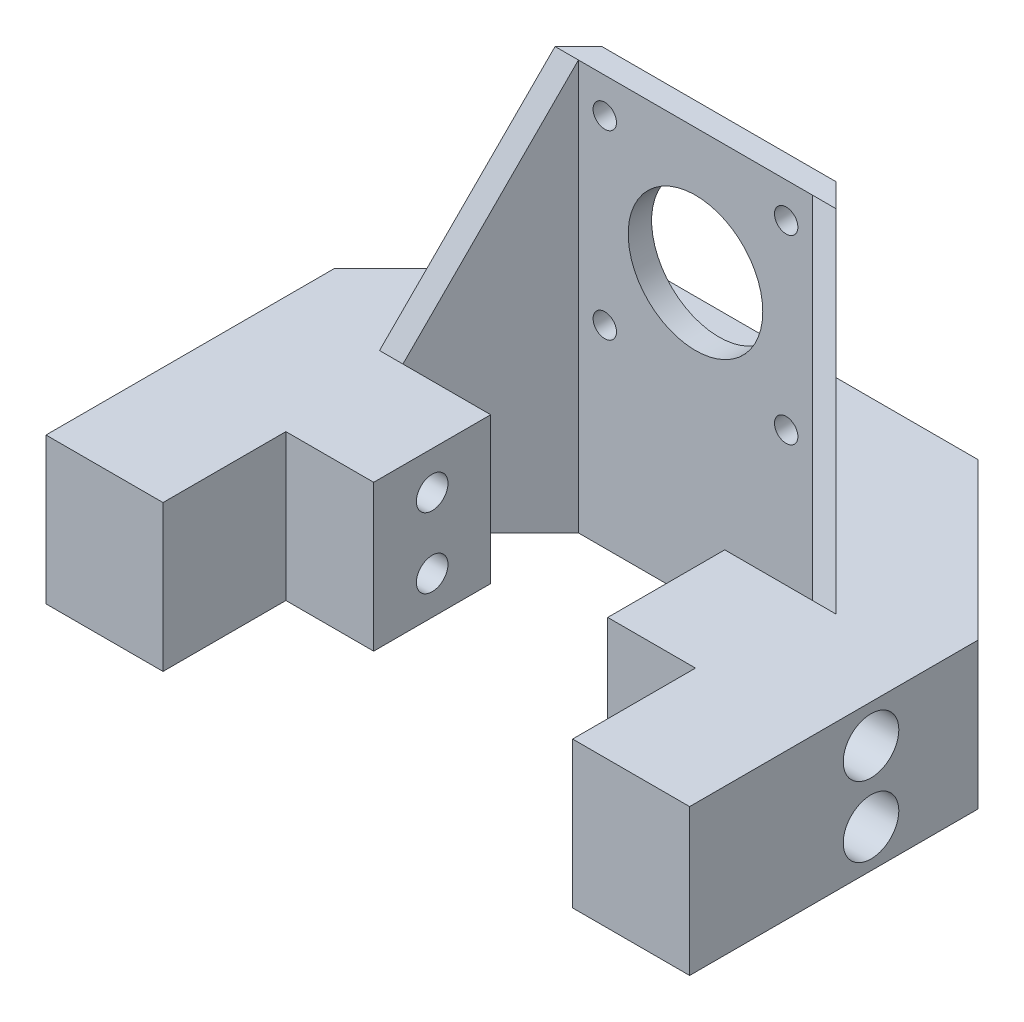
ISO-10303-21;
HEADER;
FILE_DESCRIPTION(('STEP AP214'),'2;1');
FILE_NAME('part.step','',(''),(''),'','','');
FILE_SCHEMA(('AUTOMOTIVE_DESIGN { 1 0 10303 214 1 1 1 1 }'));
ENDSEC;
DATA;
#1=APPLICATION_CONTEXT('core data for automotive mechanical design processes');
#2=APPLICATION_PROTOCOL_DEFINITION('international standard','automotive_design',2000,#1);
#3=PRODUCT_CONTEXT('',#1,'mechanical');
#4=PRODUCT('Part','Part','',(#3));
#5=PRODUCT_RELATED_PRODUCT_CATEGORY('part','',(#4));
#6=PRODUCT_DEFINITION_FORMATION('','',#4);
#7=PRODUCT_DEFINITION_CONTEXT('part definition',#1,'design');
#8=PRODUCT_DEFINITION('design','',#6,#7);
#9=PRODUCT_DEFINITION_SHAPE('','',#8);
#10=(LENGTH_UNIT() NAMED_UNIT(*) SI_UNIT(.MILLI.,.METRE.));
#11=(NAMED_UNIT(*) PLANE_ANGLE_UNIT() SI_UNIT($,.RADIAN.));
#12=(NAMED_UNIT(*) SI_UNIT($,.STERADIAN.) SOLID_ANGLE_UNIT());
#13=UNCERTAINTY_MEASURE_WITH_UNIT(LENGTH_MEASURE(1.E-05),#10,'distance_accuracy_value','');
#14=(GEOMETRIC_REPRESENTATION_CONTEXT(3) GLOBAL_UNCERTAINTY_ASSIGNED_CONTEXT((#13)) GLOBAL_UNIT_ASSIGNED_CONTEXT((#10,
#11,#12)) REPRESENTATION_CONTEXT('',''));
#15=CARTESIAN_POINT('',(0.,0.,0.));
#16=DIRECTION('',(0.,0.,1.));
#17=DIRECTION('',(1.,0.,0.));
#18=AXIS2_PLACEMENT_3D('',#15,#16,#17);
#19=CARTESIAN_POINT('',(-55.,6.5,25.));
#20=DIRECTION('',(1.,0.,0.));
#21=DIRECTION('',(0.,0.,-1.));
#22=AXIS2_PLACEMENT_3D('',#19,#20,#21);
#23=CYLINDRICAL_SURFACE('',#22,2.7);
#24=CARTESIAN_POINT('',(20.,6.5,25.));
#25=DIRECTION('',(-1.,0.,0.));
#26=DIRECTION('',(0.,0.,1.));
#27=AXIS2_PLACEMENT_3D('',#24,#25,#26);
#28=CIRCLE('',#27,2.7);
#29=CARTESIAN_POINT('',(20.,6.5,27.7));
#30=VERTEX_POINT('',#29);
#31=EDGE_CURVE('E260',#30,#30,#28,.T.);
#32=ORIENTED_EDGE('',*,*,#31,.T.);
#33=EDGE_LOOP('',(#32));
#34=FACE_BOUND('',#33,.T.);
#35=CARTESIAN_POINT('',(46.,6.5,25.));
#36=DIRECTION('',(1.,0.,0.));
#37=DIRECTION('',(0.,0.,-1.));
#38=AXIS2_PLACEMENT_3D('',#35,#36,#37);
#39=CIRCLE('',#38,2.7);
#40=CARTESIAN_POINT('',(46.,6.5,22.3));
#41=VERTEX_POINT('',#40);
#42=EDGE_CURVE('E39',#41,#41,#39,.F.);
#43=ORIENTED_EDGE('',*,*,#42,.F.);
#44=EDGE_LOOP('',(#43));
#45=FACE_BOUND('',#44,.T.);
#46=ADVANCED_FACE('F35',(#34,#45),#23,.F.);
#47=CARTESIAN_POINT('',(-55.,18.5,25.));
#48=DIRECTION('',(1.,0.,0.));
#49=DIRECTION('',(0.,0.,-1.));
#50=AXIS2_PLACEMENT_3D('',#47,#48,#49);
#51=CYLINDRICAL_SURFACE('',#50,2.7);
#52=CARTESIAN_POINT('',(20.,18.5,25.));
#53=DIRECTION('',(-1.,0.,0.));
#54=DIRECTION('',(0.,0.,1.));
#55=AXIS2_PLACEMENT_3D('',#52,#53,#54);
#56=CIRCLE('',#55,2.7);
#57=CARTESIAN_POINT('',(20.,18.5,27.7));
#58=VERTEX_POINT('',#57);
#59=EDGE_CURVE('E259',#58,#58,#56,.T.);
#60=ORIENTED_EDGE('',*,*,#59,.T.);
#61=EDGE_LOOP('',(#60));
#62=FACE_BOUND('',#61,.T.);
#63=CARTESIAN_POINT('',(46.,18.5,25.));
#64=DIRECTION('',(1.,0.,0.));
#65=DIRECTION('',(0.,0.,-1.));
#66=AXIS2_PLACEMENT_3D('',#63,#64,#65);
#67=CIRCLE('',#66,2.7);
#68=CARTESIAN_POINT('',(46.,18.5,22.3));
#69=VERTEX_POINT('',#68);
#70=EDGE_CURVE('E234',#69,#69,#67,.F.);
#71=ORIENTED_EDGE('',*,*,#70,.F.);
#72=EDGE_LOOP('',(#71));
#73=FACE_BOUND('',#72,.T.);
#74=ADVANCED_FACE('F457',(#62,#73),#51,.F.);
#75=CARTESIAN_POINT('',(-20.,6.5,25.));
#76=DIRECTION('',(1.,0.,0.));
#77=DIRECTION('',(0.,0.,-1.));
#78=AXIS2_PLACEMENT_3D('',#75,#76,#77);
#79=CIRCLE('',#78,2.7);
#80=CARTESIAN_POINT('',(-20.,6.5,22.3));
#81=VERTEX_POINT('',#80);
#82=EDGE_CURVE('E256',#81,#81,#79,.T.);
#83=ORIENTED_EDGE('',*,*,#82,.T.);
#84=EDGE_LOOP('',(#83));
#85=FACE_BOUND('',#84,.T.);
#86=CARTESIAN_POINT('',(-46.,6.5,25.));
#87=DIRECTION('',(-1.,0.,0.));
#88=DIRECTION('',(0.,0.,1.));
#89=AXIS2_PLACEMENT_3D('',#86,#87,#88);
#90=CIRCLE('',#89,2.7);
#91=CARTESIAN_POINT('',(-46.,6.5,27.7));
#92=VERTEX_POINT('',#91);
#93=EDGE_CURVE('E442',#92,#92,#90,.F.);
#94=ORIENTED_EDGE('',*,*,#93,.F.);
#95=EDGE_LOOP('',(#94));
#96=FACE_BOUND('',#95,.T.);
#97=ADVANCED_FACE('F460',(#85,#96),#23,.F.);
#98=CARTESIAN_POINT('',(-20.,18.5,25.));
#99=DIRECTION('',(1.,0.,0.));
#100=DIRECTION('',(0.,0.,-1.));
#101=AXIS2_PLACEMENT_3D('',#98,#99,#100);
#102=CIRCLE('',#101,2.7);
#103=CARTESIAN_POINT('',(-20.,18.5,22.3));
#104=VERTEX_POINT('',#103);
#105=EDGE_CURVE('E261',#104,#104,#102,.T.);
#106=ORIENTED_EDGE('',*,*,#105,.T.);
#107=EDGE_LOOP('',(#106));
#108=FACE_BOUND('',#107,.T.);
#109=CARTESIAN_POINT('',(-46.,18.5,25.));
#110=DIRECTION('',(-1.,0.,0.));
#111=DIRECTION('',(0.,0.,1.));
#112=AXIS2_PLACEMENT_3D('',#109,#110,#111);
#113=CIRCLE('',#112,2.7);
#114=CARTESIAN_POINT('',(-46.,18.5,27.7));
#115=VERTEX_POINT('',#114);
#116=EDGE_CURVE('E246',#115,#115,#113,.F.);
#117=ORIENTED_EDGE('',*,*,#116,.F.);
#118=EDGE_LOOP('',(#117));
#119=FACE_BOUND('',#118,.T.);
#120=ADVANCED_FACE('F466',(#108,#119),#51,.F.);
#121=CARTESIAN_POINT('',(35.,25.,15.));
#122=DIRECTION('',(-0.707106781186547,0.,0.707106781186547));
#123=DIRECTION('',(0.707106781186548,0.,0.707106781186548));
#124=AXIS2_PLACEMENT_3D('',#121,#122,#123);
#125=PLANE('',#124);
#126=DIRECTION('',(0.,-1.,0.));
#127=VECTOR('',#126,1.);
#128=CARTESIAN_POINT('',(35.,25.,15.));
#129=LINE('',#128,#127);
#130=CARTESIAN_POINT('',(35.,25.,15.));
#131=VERTEX_POINT('',#130);
#132=CARTESIAN_POINT('',(35.,0.,15.));
#133=VERTEX_POINT('',#132);
#134=EDGE_CURVE('E410',#131,#133,#129,.T.);
#135=ORIENTED_EDGE('',*,*,#134,.F.);
#136=DIRECTION('',(-0.301511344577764,0.904534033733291,-0.301511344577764));
#137=VECTOR('',#136,1.);
#138=CARTESIAN_POINT('',(35.,25.,15.));
#139=LINE('',#138,#137);
#140=CARTESIAN_POINT('',(20.,70.,0.));
#141=VERTEX_POINT('',#140);
#142=EDGE_CURVE('E298',#131,#141,#139,.T.);
#143=ORIENTED_EDGE('',*,*,#142,.T.);
#144=DIRECTION('',(0.,-1.,0.));
#145=VECTOR('',#144,1.);
#146=CARTESIAN_POINT('',(20.,25.,0.));
#147=LINE('',#146,#145);
#148=CARTESIAN_POINT('',(20.,0.,0.));
#149=VERTEX_POINT('',#148);
#150=EDGE_CURVE('E390',#141,#149,#147,.T.);
#151=ORIENTED_EDGE('',*,*,#150,.T.);
#152=DIRECTION('',(-0.707106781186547,0.,-0.707106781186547));
#153=VECTOR('',#152,1.);
#154=CARTESIAN_POINT('',(35.,0.,15.));
#155=LINE('',#154,#153);
#156=EDGE_CURVE('E373',#133,#149,#155,.T.);
#157=ORIENTED_EDGE('',*,*,#156,.F.);
#158=EDGE_LOOP('',(#135,#143,#151,#157));
#159=FACE_BOUND('',#158,.T.);
#160=ADVANCED_FACE('F37',(#159),#125,.T.);
#161=CARTESIAN_POINT('',(-35.,25.,15.));
#162=DIRECTION('',(-0.707106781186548,0.,-0.707106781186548));
#163=DIRECTION('',(-0.707106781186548,0.,0.707106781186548));
#164=AXIS2_PLACEMENT_3D('',#161,#162,#163);
#165=PLANE('',#164);
#166=DIRECTION('',(0.301511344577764,0.904534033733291,-0.301511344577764));
#167=VECTOR('',#166,1.);
#168=CARTESIAN_POINT('',(-35.,25.,15.));
#169=LINE('',#168,#167);
#170=CARTESIAN_POINT('',(-35.,25.,15.));
#171=VERTEX_POINT('',#170);
#172=CARTESIAN_POINT('',(-20.,70.,0.));
#173=VERTEX_POINT('',#172);
#174=EDGE_CURVE('E296',#171,#173,#169,.T.);
#175=ORIENTED_EDGE('',*,*,#174,.F.);
#176=DIRECTION('',(0.,-1.,0.));
#177=VECTOR('',#176,1.);
#178=CARTESIAN_POINT('',(-35.,25.,15.));
#179=LINE('',#178,#177);
#180=CARTESIAN_POINT('',(-35.,0.,15.));
#181=VERTEX_POINT('',#180);
#182=EDGE_CURVE('E421',#171,#181,#179,.T.);
#183=ORIENTED_EDGE('',*,*,#182,.T.);
#184=DIRECTION('',(0.707106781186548,0.,-0.707106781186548));
#185=VECTOR('',#184,1.);
#186=CARTESIAN_POINT('',(-35.,0.,15.));
#187=LINE('',#186,#185);
#188=CARTESIAN_POINT('',(-20.,0.,0.));
#189=VERTEX_POINT('',#188);
#190=EDGE_CURVE('E395',#181,#189,#187,.T.);
#191=ORIENTED_EDGE('',*,*,#190,.T.);
#192=DIRECTION('',(0.,-1.,0.));
#193=VECTOR('',#192,1.);
#194=CARTESIAN_POINT('',(-20.,25.,0.));
#195=LINE('',#194,#193);
#196=EDGE_CURVE('E424',#173,#189,#195,.T.);
#197=ORIENTED_EDGE('',*,*,#196,.F.);
#198=EDGE_LOOP('',(#175,#183,#191,#197));
#199=FACE_BOUND('',#198,.T.);
#200=ADVANCED_FACE('F571',(#199),#165,.F.);
#201=CARTESIAN_POINT('',(39.,70.,15.));
#202=DIRECTION('',(-0.707106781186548,0.,0.707106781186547));
#203=DIRECTION('',(0.707106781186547,0.,0.707106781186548));
#204=AXIS2_PLACEMENT_3D('',#201,#202,#203);
#205=PLANE('',#204);
#206=DIRECTION('',(-0.301511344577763,0.904534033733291,-0.301511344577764));
#207=VECTOR('',#206,1.);
#208=CARTESIAN_POINT('',(26.7272727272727,61.8181818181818,2.72727272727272));
#209=LINE('',#208,#207);
#210=CARTESIAN_POINT('',(39.,25.,15.));
#211=VERTEX_POINT('',#210);
#212=CARTESIAN_POINT('',(24.,70.,0.));
#213=VERTEX_POINT('',#212);
#214=EDGE_CURVE('E52',#211,#213,#209,.T.);
#215=ORIENTED_EDGE('',*,*,#214,.F.);
#216=DIRECTION('',(-0.707106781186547,0.,-0.707106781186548));
#217=VECTOR('',#216,1.);
#218=CARTESIAN_POINT('',(39.,25.,15.));
#219=LINE('',#218,#217);
#220=CARTESIAN_POINT('',(20.,25.,-4.));
#221=VERTEX_POINT('',#220);
#222=EDGE_CURVE('E315',#211,#221,#219,.T.);
#223=ORIENTED_EDGE('',*,*,#222,.T.);
#224=DIRECTION('',(0.,-1.,0.));
#225=VECTOR('',#224,1.);
#226=CARTESIAN_POINT('',(20.,70.,-4.));
#227=LINE('',#226,#225);
#228=CARTESIAN_POINT('',(20.,70.,-4.));
#229=VERTEX_POINT('',#228);
#230=EDGE_CURVE('E324',#229,#221,#227,.T.);
#231=ORIENTED_EDGE('',*,*,#230,.F.);
#232=DIRECTION('',(-0.707106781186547,0.,-0.707106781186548));
#233=VECTOR('',#232,1.);
#234=CARTESIAN_POINT('',(39.,70.,15.));
#235=LINE('',#234,#233);
#236=EDGE_CURVE('E305',#213,#229,#235,.T.);
#237=ORIENTED_EDGE('',*,*,#236,.F.);
#238=EDGE_LOOP('',(#215,#223,#231,#237));
#239=FACE_BOUND('',#238,.T.);
#240=ADVANCED_FACE('F595',(#239),#205,.F.);
#241=CARTESIAN_POINT('',(-39.,70.,15.));
#242=DIRECTION('',(0.707106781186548,0.,0.707106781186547));
#243=DIRECTION('',(0.707106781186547,0.,-0.707106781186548));
#244=AXIS2_PLACEMENT_3D('',#241,#242,#243);
#245=PLANE('',#244);
#246=DIRECTION('',(-0.301511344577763,-0.904534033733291,0.301511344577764));
#247=VECTOR('',#246,1.);
#248=CARTESIAN_POINT('',(-26.7272727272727,61.8181818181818,2.72727272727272));
#249=LINE('',#248,#247);
#250=CARTESIAN_POINT('',(-24.,70.,0.));
#251=VERTEX_POINT('',#250);
#252=CARTESIAN_POINT('',(-39.,25.,15.));
#253=VERTEX_POINT('',#252);
#254=EDGE_CURVE('E292',#251,#253,#249,.T.);
#255=ORIENTED_EDGE('',*,*,#254,.F.);
#256=DIRECTION('',(-0.707106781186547,0.,0.707106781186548));
#257=VECTOR('',#256,1.);
#258=CARTESIAN_POINT('',(-39.,70.,15.));
#259=LINE('',#258,#257);
#260=CARTESIAN_POINT('',(-20.,70.,-4.));
#261=VERTEX_POINT('',#260);
#262=EDGE_CURVE('E310',#261,#251,#259,.T.);
#263=ORIENTED_EDGE('',*,*,#262,.F.);
#264=DIRECTION('',(0.,-1.,0.));
#265=VECTOR('',#264,1.);
#266=CARTESIAN_POINT('',(-20.,70.,-4.));
#267=LINE('',#266,#265);
#268=CARTESIAN_POINT('',(-20.,25.,-4.));
#269=VERTEX_POINT('',#268);
#270=EDGE_CURVE('E313',#261,#269,#267,.T.);
#271=ORIENTED_EDGE('',*,*,#270,.T.);
#272=DIRECTION('',(-0.707106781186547,0.,0.707106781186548));
#273=VECTOR('',#272,1.);
#274=CARTESIAN_POINT('',(-39.,25.,15.));
#275=LINE('',#274,#273);
#276=EDGE_CURVE('E60',#269,#253,#275,.T.);
#277=ORIENTED_EDGE('',*,*,#276,.T.);
#278=EDGE_LOOP('',(#255,#263,#271,#277));
#279=FACE_BOUND('',#278,.T.);
#280=ADVANCED_FACE('F600',(#279),#245,.F.);
#281=CARTESIAN_POINT('',(0.,70.,0.));
#282=DIRECTION('',(0.,1.,0.));
#283=DIRECTION('',(0.,0.,1.));
#284=AXIS2_PLACEMENT_3D('',#281,#282,#283);
#285=PLANE('',#284);
#286=ORIENTED_EDGE('',*,*,#262,.T.);
#287=DIRECTION('',(1.,0.,0.));
#288=VECTOR('',#287,1.);
#289=CARTESIAN_POINT('',(0.,70.,0.));
#290=LINE('',#289,#288);
#291=EDGE_CURVE('E11',#251,#173,#290,.T.);
#292=ORIENTED_EDGE('',*,*,#291,.T.);
#293=DIRECTION('',(1.,0.,0.));
#294=VECTOR('',#293,1.);
#295=CARTESIAN_POINT('',(-20.,70.,0.));
#296=LINE('',#295,#294);
#297=EDGE_CURVE('E302',#173,#141,#296,.T.);
#298=ORIENTED_EDGE('',*,*,#297,.T.);
#299=EDGE_CURVE('E44',#141,#213,#290,.T.);
#300=ORIENTED_EDGE('',*,*,#299,.T.);
#301=ORIENTED_EDGE('',*,*,#236,.T.);
#302=DIRECTION('',(-1.,0.,0.));
#303=VECTOR('',#302,1.);
#304=CARTESIAN_POINT('',(-20.,70.,-4.));
#305=LINE('',#304,#303);
#306=EDGE_CURVE('E308',#229,#261,#305,.T.);
#307=ORIENTED_EDGE('',*,*,#306,.T.);
#308=EDGE_LOOP('',(#286,#292,#298,#300,#301,#307));
#309=FACE_BOUND('',#308,.T.);
#310=ADVANCED_FACE('F689',(#309),#285,.T.);
#311=CARTESIAN_POINT('',(0.,25.,0.));
#312=DIRECTION('',(0.,-1.,0.));
#313=DIRECTION('',(0.,0.,-1.));
#314=AXIS2_PLACEMENT_3D('',#311,#312,#313);
#315=PLANE('',#314);
#316=ORIENTED_EDGE('',*,*,#222,.F.);
#317=DIRECTION('',(1.,0.,0.));
#318=VECTOR('',#317,1.);
#319=CARTESIAN_POINT('',(35.,25.,15.));
#320=LINE('',#319,#318);
#321=EDGE_CURVE('E301',#131,#211,#320,.T.);
#322=ORIENTED_EDGE('',*,*,#321,.F.);
#323=DIRECTION('',(-1.,0.,0.));
#324=VECTOR('',#323,1.);
#325=CARTESIAN_POINT('',(35.,25.,15.));
#326=LINE('',#325,#324);
#327=CARTESIAN_POINT('',(20.,25.,15.));
#328=VERTEX_POINT('',#327);
#329=EDGE_CURVE('E327',#131,#328,#326,.T.);
#330=ORIENTED_EDGE('',*,*,#329,.T.);
#331=DIRECTION('',(0.,0.,1.));
#332=VECTOR('',#331,1.);
#333=CARTESIAN_POINT('',(20.,25.,15.));
#334=LINE('',#333,#332);
#335=CARTESIAN_POINT('',(20.,25.,35.));
#336=VERTEX_POINT('',#335);
#337=EDGE_CURVE('E332',#328,#336,#334,.T.);
#338=ORIENTED_EDGE('',*,*,#337,.T.);
#339=DIRECTION('',(1.,0.,0.));
#340=VECTOR('',#339,1.);
#341=CARTESIAN_POINT('',(35.,25.,35.));
#342=LINE('',#341,#340);
#343=CARTESIAN_POINT('',(35.,25.,35.));
#344=VERTEX_POINT('',#343);
#345=EDGE_CURVE('E328',#336,#344,#342,.T.);
#346=ORIENTED_EDGE('',*,*,#345,.T.);
#347=DIRECTION('',(0.,0.,-1.));
#348=VECTOR('',#347,1.);
#349=CARTESIAN_POINT('',(35.,25.,40.));
#350=LINE('',#349,#348);
#351=CARTESIAN_POINT('',(35.,25.,56.));
#352=VERTEX_POINT('',#351);
#353=EDGE_CURVE('E388',#352,#344,#350,.T.);
#354=ORIENTED_EDGE('',*,*,#353,.F.);
#355=DIRECTION('',(-1.,0.,0.));
#356=VECTOR('',#355,1.);
#357=CARTESIAN_POINT('',(35.,25.,56.));
#358=LINE('',#357,#356);
#359=CARTESIAN_POINT('',(55.,25.,56.));
#360=VERTEX_POINT('',#359);
#361=EDGE_CURVE('E213',#360,#352,#358,.T.);
#362=ORIENTED_EDGE('',*,*,#361,.F.);
#363=DIRECTION('',(0.,0.,1.));
#364=VECTOR('',#363,1.);
#365=CARTESIAN_POINT('',(55.,25.,6.71572875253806));
#366=LINE('',#365,#364);
#367=CARTESIAN_POINT('',(55.,25.,6.71572875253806));
#368=VERTEX_POINT('',#367);
#369=EDGE_CURVE('E386',#368,#360,#366,.T.);
#370=ORIENTED_EDGE('',*,*,#369,.F.);
#371=DIRECTION('',(0.707106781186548,0.,0.707106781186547));
#372=VECTOR('',#371,1.);
#373=CARTESIAN_POINT('',(28.2842712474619,25.,-20.));
#374=LINE('',#373,#372);
#375=CARTESIAN_POINT('',(28.2842712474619,25.,-20.));
#376=VERTEX_POINT('',#375);
#377=EDGE_CURVE('E383',#376,#368,#374,.T.);
#378=ORIENTED_EDGE('',*,*,#377,.F.);
#379=DIRECTION('',(1.,0.,0.));
#380=VECTOR('',#379,1.);
#381=CARTESIAN_POINT('',(-28.2842712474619,25.,-20.));
#382=LINE('',#381,#380);
#383=CARTESIAN_POINT('',(-28.2842712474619,25.,-20.));
#384=VERTEX_POINT('',#383);
#385=EDGE_CURVE('E380',#384,#376,#382,.T.);
#386=ORIENTED_EDGE('',*,*,#385,.F.);
#387=DIRECTION('',(-0.707106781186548,0.,0.707106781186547));
#388=VECTOR('',#387,1.);
#389=CARTESIAN_POINT('',(-28.2842712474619,25.,-20.));
#390=LINE('',#389,#388);
#391=CARTESIAN_POINT('',(-55.,25.,6.71572875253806));
#392=VERTEX_POINT('',#391);
#393=EDGE_CURVE('E378',#384,#392,#390,.T.);
#394=ORIENTED_EDGE('',*,*,#393,.T.);
#395=DIRECTION('',(0.,0.,1.));
#396=VECTOR('',#395,1.);
#397=CARTESIAN_POINT('',(-55.,25.,6.71572875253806));
#398=LINE('',#397,#396);
#399=CARTESIAN_POINT('',(-55.,25.,56.));
#400=VERTEX_POINT('',#399);
#401=EDGE_CURVE('E376',#392,#400,#398,.T.);
#402=ORIENTED_EDGE('',*,*,#401,.T.);
#403=DIRECTION('',(-1.,0.,0.));
#404=VECTOR('',#403,1.);
#405=CARTESIAN_POINT('',(-55.,25.,56.));
#406=LINE('',#405,#404);
#407=CARTESIAN_POINT('',(-35.,25.,56.));
#408=VERTEX_POINT('',#407);
#409=EDGE_CURVE('E227',#408,#400,#406,.T.);
#410=ORIENTED_EDGE('',*,*,#409,.F.);
#411=DIRECTION('',(0.,0.,-1.));
#412=VECTOR('',#411,1.);
#413=CARTESIAN_POINT('',(-35.,25.,40.));
#414=LINE('',#413,#412);
#415=CARTESIAN_POINT('',(-35.,25.,35.));
#416=VERTEX_POINT('',#415);
#417=EDGE_CURVE('E196',#408,#416,#414,.T.);
#418=ORIENTED_EDGE('',*,*,#417,.T.);
#419=DIRECTION('',(1.,0.,0.));
#420=VECTOR('',#419,1.);
#421=CARTESIAN_POINT('',(-35.,25.,35.));
#422=LINE('',#421,#420);
#423=CARTESIAN_POINT('',(-20.,25.,35.));
#424=VERTEX_POINT('',#423);
#425=EDGE_CURVE('E349',#416,#424,#422,.T.);
#426=ORIENTED_EDGE('',*,*,#425,.T.);
#427=DIRECTION('',(0.,0.,-1.));
#428=VECTOR('',#427,1.);
#429=CARTESIAN_POINT('',(-20.,25.,15.));
#430=LINE('',#429,#428);
#431=CARTESIAN_POINT('',(-20.,25.,15.));
#432=VERTEX_POINT('',#431);
#433=EDGE_CURVE('E354',#424,#432,#430,.T.);
#434=ORIENTED_EDGE('',*,*,#433,.T.);
#435=DIRECTION('',(-1.,0.,0.));
#436=VECTOR('',#435,1.);
#437=CARTESIAN_POINT('',(-35.,25.,15.));
#438=LINE('',#437,#436);
#439=EDGE_CURVE('E350',#432,#171,#438,.T.);
#440=ORIENTED_EDGE('',*,*,#439,.T.);
#441=DIRECTION('',(1.,0.,0.));
#442=VECTOR('',#441,1.);
#443=CARTESIAN_POINT('',(-35.,25.,15.));
#444=LINE('',#443,#442);
#445=EDGE_CURVE('E306',#253,#171,#444,.T.);
#446=ORIENTED_EDGE('',*,*,#445,.F.);
#447=ORIENTED_EDGE('',*,*,#276,.F.);
#448=DIRECTION('',(-1.,0.,0.));
#449=VECTOR('',#448,1.);
#450=CARTESIAN_POINT('',(-20.,25.,-4.));
#451=LINE('',#450,#449);
#452=EDGE_CURVE('E318',#221,#269,#451,.T.);
#453=ORIENTED_EDGE('',*,*,#452,.F.);
#454=EDGE_LOOP('',(#316,#322,#330,#338,#346,#354,#362,#370,#378,#386,#394,#402,#410,#418,#426,
#434,#440,#446,#447,#453));
#455=FACE_BOUND('',#454,.T.);
#456=ADVANCED_FACE('F532',(#455),#315,.F.);
#457=CARTESIAN_POINT('',(35.,25.,40.));
#458=DIRECTION('',(-1.,0.,0.));
#459=DIRECTION('',(0.,0.,1.));
#460=AXIS2_PLACEMENT_3D('',#457,#458,#459);
#461=PLANE('',#460);
#462=DIRECTION('',(0.,1.,0.));
#463=VECTOR('',#462,1.);
#464=CARTESIAN_POINT('',(35.,-25.,35.));
#465=LINE('',#464,#463);
#466=CARTESIAN_POINT('',(35.,0.,35.));
#467=VERTEX_POINT('',#466);
#468=EDGE_CURVE('E194',#467,#344,#465,.T.);
#469=ORIENTED_EDGE('',*,*,#468,.F.);
#470=DIRECTION('',(0.,0.,-1.));
#471=VECTOR('',#470,1.);
#472=CARTESIAN_POINT('',(35.,0.,40.));
#473=LINE('',#472,#471);
#474=CARTESIAN_POINT('',(35.,0.,56.));
#475=VERTEX_POINT('',#474);
#476=EDGE_CURVE('E188',#475,#467,#473,.T.);
#477=ORIENTED_EDGE('',*,*,#476,.F.);
#478=DIRECTION('',(0.,-1.,0.));
#479=VECTOR('',#478,1.);
#480=CARTESIAN_POINT('',(35.,25.,56.));
#481=LINE('',#480,#479);
#482=EDGE_CURVE('E193',#352,#475,#481,.T.);
#483=ORIENTED_EDGE('',*,*,#482,.F.);
#484=ORIENTED_EDGE('',*,*,#353,.T.);
#485=EDGE_LOOP('',(#469,#477,#483,#484));
#486=FACE_BOUND('',#485,.T.);
#487=ADVANCED_FACE('F190',(#486),#461,.T.);
#488=CARTESIAN_POINT('',(55.,25.,6.71572875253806));
#489=DIRECTION('',(1.,0.,0.));
#490=DIRECTION('',(0.,0.,-1.));
#491=AXIS2_PLACEMENT_3D('',#488,#489,#490);
#492=PLANE('',#491);
#493=CARTESIAN_POINT('',(55.,18.5,25.));
#494=DIRECTION('',(1.,0.,0.));
#495=DIRECTION('',(0.,0.,-1.));
#496=AXIS2_PLACEMENT_3D('',#493,#494,#495);
#497=CIRCLE('',#496,4.75);
#498=CARTESIAN_POINT('',(55.,18.5,20.25));
#499=VERTEX_POINT('',#498);
#500=EDGE_CURVE('E235',#499,#499,#497,.T.);
#501=ORIENTED_EDGE('',*,*,#500,.F.);
#502=EDGE_LOOP('',(#501));
#503=FACE_BOUND('',#502,.T.);
#504=CARTESIAN_POINT('',(55.,6.5,25.));
#505=DIRECTION('',(1.,0.,0.));
#506=DIRECTION('',(0.,0.,-1.));
#507=AXIS2_PLACEMENT_3D('',#504,#505,#506);
#508=CIRCLE('',#507,4.75);
#509=CARTESIAN_POINT('',(55.,6.5,20.25));
#510=VERTEX_POINT('',#509);
#511=EDGE_CURVE('E230',#510,#510,#508,.T.);
#512=ORIENTED_EDGE('',*,*,#511,.F.);
#513=EDGE_LOOP('',(#512));
#514=FACE_BOUND('',#513,.T.);
#515=DIRECTION('',(0.,0.,1.));
#516=VECTOR('',#515,1.);
#517=CARTESIAN_POINT('',(55.,0.,6.71572875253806));
#518=LINE('',#517,#516);
#519=CARTESIAN_POINT('',(55.,0.,6.71572875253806));
#520=VERTEX_POINT('',#519);
#521=CARTESIAN_POINT('',(55.,0.,56.));
#522=VERTEX_POINT('',#521);
#523=EDGE_CURVE('E197',#520,#522,#518,.T.);
#524=ORIENTED_EDGE('',*,*,#523,.F.);
#525=DIRECTION('',(0.,-1.,0.));
#526=VECTOR('',#525,1.);
#527=CARTESIAN_POINT('',(55.,25.,6.71572875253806));
#528=LINE('',#527,#526);
#529=EDGE_CURVE('E412',#368,#520,#528,.T.);
#530=ORIENTED_EDGE('',*,*,#529,.F.);
#531=ORIENTED_EDGE('',*,*,#369,.T.);
#532=DIRECTION('',(0.,1.,0.));
#533=VECTOR('',#532,1.);
#534=CARTESIAN_POINT('',(55.,25.,56.));
#535=LINE('',#534,#533);
#536=EDGE_CURVE('E208',#522,#360,#535,.T.);
#537=ORIENTED_EDGE('',*,*,#536,.F.);
#538=EDGE_LOOP('',(#524,#530,#531,#537));
#539=FACE_BOUND('',#538,.T.);
#540=ADVANCED_FACE('F546',(#503,#514,#539),#492,.T.);
#541=CARTESIAN_POINT('',(28.2842712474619,25.,-20.));
#542=DIRECTION('',(0.707106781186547,0.,-0.707106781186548));
#543=DIRECTION('',(-0.707106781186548,0.,-0.707106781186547));
#544=AXIS2_PLACEMENT_3D('',#541,#542,#543);
#545=PLANE('',#544);
#546=DIRECTION('',(0.707106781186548,0.,0.707106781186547));
#547=VECTOR('',#546,1.);
#548=CARTESIAN_POINT('',(28.2842712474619,0.,-20.));
#549=LINE('',#548,#547);
#550=CARTESIAN_POINT('',(28.2842712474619,0.,-20.));
#551=VERTEX_POINT('',#550);
#552=EDGE_CURVE('E407',#551,#520,#549,.T.);
#553=ORIENTED_EDGE('',*,*,#552,.F.);
#554=DIRECTION('',(0.,-1.,0.));
#555=VECTOR('',#554,1.);
#556=CARTESIAN_POINT('',(28.2842712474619,25.,-20.));
#557=LINE('',#556,#555);
#558=EDGE_CURVE('E414',#376,#551,#557,.T.);
#559=ORIENTED_EDGE('',*,*,#558,.F.);
#560=ORIENTED_EDGE('',*,*,#377,.T.);
#561=ORIENTED_EDGE('',*,*,#529,.T.);
#562=EDGE_LOOP('',(#553,#559,#560,#561));
#563=FACE_BOUND('',#562,.T.);
#564=ADVANCED_FACE('F543',(#563),#545,.T.);
#565=CARTESIAN_POINT('',(-28.2842712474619,25.,-20.));
#566=DIRECTION('',(0.,0.,-1.));
#567=DIRECTION('',(-1.,0.,0.));
#568=AXIS2_PLACEMENT_3D('',#565,#566,#567);
#569=PLANE('',#568);
#570=DIRECTION('',(1.,0.,0.));
#571=VECTOR('',#570,1.);
#572=CARTESIAN_POINT('',(-28.2842712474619,0.,-20.));
#573=LINE('',#572,#571);
#574=CARTESIAN_POINT('',(-28.2842712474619,0.,-20.));
#575=VERTEX_POINT('',#574);
#576=EDGE_CURVE('E404',#575,#551,#573,.T.);
#577=ORIENTED_EDGE('',*,*,#576,.F.);
#578=DIRECTION('',(0.,-1.,0.));
#579=VECTOR('',#578,1.);
#580=CARTESIAN_POINT('',(-28.2842712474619,25.,-20.));
#581=LINE('',#580,#579);
#582=EDGE_CURVE('E416',#384,#575,#581,.T.);
#583=ORIENTED_EDGE('',*,*,#582,.F.);
#584=ORIENTED_EDGE('',*,*,#385,.T.);
#585=ORIENTED_EDGE('',*,*,#558,.T.);
#586=EDGE_LOOP('',(#577,#583,#584,#585));
#587=FACE_BOUND('',#586,.T.);
#588=ADVANCED_FACE('F540',(#587),#569,.T.);
#589=CARTESIAN_POINT('',(-28.2842712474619,25.,-20.));
#590=DIRECTION('',(0.707106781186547,0.,0.707106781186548));
#591=DIRECTION('',(0.707106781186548,0.,-0.707106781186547));
#592=AXIS2_PLACEMENT_3D('',#589,#590,#591);
#593=PLANE('',#592);
#594=DIRECTION('',(-0.707106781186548,0.,0.707106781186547));
#595=VECTOR('',#594,1.);
#596=CARTESIAN_POINT('',(-28.2842712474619,0.,-20.));
#597=LINE('',#596,#595);
#598=CARTESIAN_POINT('',(-55.,0.,6.71572875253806));
#599=VERTEX_POINT('',#598);
#600=EDGE_CURVE('E402',#575,#599,#597,.T.);
#601=ORIENTED_EDGE('',*,*,#600,.T.);
#602=DIRECTION('',(0.,-1.,0.));
#603=VECTOR('',#602,1.);
#604=CARTESIAN_POINT('',(-55.,25.,6.71572875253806));
#605=LINE('',#604,#603);
#606=EDGE_CURVE('E418',#392,#599,#605,.T.);
#607=ORIENTED_EDGE('',*,*,#606,.F.);
#608=ORIENTED_EDGE('',*,*,#393,.F.);
#609=ORIENTED_EDGE('',*,*,#582,.T.);
#610=EDGE_LOOP('',(#601,#607,#608,#609));
#611=FACE_BOUND('',#610,.T.);
#612=ADVANCED_FACE('F517',(#611),#593,.F.);
#613=CARTESIAN_POINT('',(-55.,25.,6.71572875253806));
#614=DIRECTION('',(1.,0.,0.));
#615=DIRECTION('',(0.,0.,-1.));
#616=AXIS2_PLACEMENT_3D('',#613,#614,#615);
#617=PLANE('',#616);
#618=CARTESIAN_POINT('',(-55.,6.5,25.));
#619=DIRECTION('',(-1.,0.,0.));
#620=DIRECTION('',(0.,0.,1.));
#621=AXIS2_PLACEMENT_3D('',#618,#619,#620);
#622=CIRCLE('',#621,4.75);
#623=CARTESIAN_POINT('',(-55.,6.5,29.75));
#624=VERTEX_POINT('',#623);
#625=EDGE_CURVE('E247',#624,#624,#622,.T.);
#626=ORIENTED_EDGE('',*,*,#625,.F.);
#627=EDGE_LOOP('',(#626));
#628=FACE_BOUND('',#627,.T.);
#629=CARTESIAN_POINT('',(-55.,18.5,25.));
#630=DIRECTION('',(-1.,0.,0.));
#631=DIRECTION('',(0.,0.,1.));
#632=AXIS2_PLACEMENT_3D('',#629,#630,#631);
#633=CIRCLE('',#632,4.75);
#634=CARTESIAN_POINT('',(-55.,18.5,29.75));
#635=VERTEX_POINT('',#634);
#636=EDGE_CURVE('E253',#635,#635,#633,.T.);
#637=ORIENTED_EDGE('',*,*,#636,.F.);
#638=EDGE_LOOP('',(#637));
#639=FACE_BOUND('',#638,.T.);
#640=DIRECTION('',(0.,0.,1.));
#641=VECTOR('',#640,1.);
#642=CARTESIAN_POINT('',(-55.,0.,6.71572875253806));
#643=LINE('',#642,#641);
#644=CARTESIAN_POINT('',(-55.,0.,56.));
#645=VERTEX_POINT('',#644);
#646=EDGE_CURVE('E400',#599,#645,#643,.T.);
#647=ORIENTED_EDGE('',*,*,#646,.T.);
#648=DIRECTION('',(0.,-1.,0.));
#649=VECTOR('',#648,1.);
#650=CARTESIAN_POINT('',(-55.,0.,56.));
#651=LINE('',#650,#649);
#652=EDGE_CURVE('E218',#400,#645,#651,.T.);
#653=ORIENTED_EDGE('',*,*,#652,.F.);
#654=ORIENTED_EDGE('',*,*,#401,.F.);
#655=ORIENTED_EDGE('',*,*,#606,.T.);
#656=EDGE_LOOP('',(#647,#653,#654,#655));
#657=FACE_BOUND('',#656,.T.);
#658=ADVANCED_FACE('F513',(#628,#639,#657),#617,.F.);
#659=CARTESIAN_POINT('',(-35.,25.,40.));
#660=DIRECTION('',(-1.,0.,0.));
#661=DIRECTION('',(0.,0.,1.));
#662=AXIS2_PLACEMENT_3D('',#659,#660,#661);
#663=PLANE('',#662);
#664=DIRECTION('',(0.,0.,-1.));
#665=VECTOR('',#664,1.);
#666=CARTESIAN_POINT('',(-35.,0.,40.));
#667=LINE('',#666,#665);
#668=CARTESIAN_POINT('',(-35.,0.,56.));
#669=VERTEX_POINT('',#668);
#670=CARTESIAN_POINT('',(-35.,0.,35.));
#671=VERTEX_POINT('',#670);
#672=EDGE_CURVE('E398',#669,#671,#667,.T.);
#673=ORIENTED_EDGE('',*,*,#672,.T.);
#674=DIRECTION('',(0.,1.,0.));
#675=VECTOR('',#674,1.);
#676=CARTESIAN_POINT('',(-35.,-25.,35.));
#677=LINE('',#676,#675);
#678=EDGE_CURVE('E365',#671,#416,#677,.T.);
#679=ORIENTED_EDGE('',*,*,#678,.T.);
#680=ORIENTED_EDGE('',*,*,#417,.F.);
#681=DIRECTION('',(0.,1.,0.));
#682=VECTOR('',#681,1.);
#683=CARTESIAN_POINT('',(-35.,0.,56.));
#684=LINE('',#683,#682);
#685=EDGE_CURVE('E224',#669,#408,#684,.T.);
#686=ORIENTED_EDGE('',*,*,#685,.F.);
#687=EDGE_LOOP('',(#673,#679,#680,#686));
#688=FACE_BOUND('',#687,.T.);
#689=ADVANCED_FACE('F516',(#688),#663,.F.);
#690=CARTESIAN_POINT('',(20.,25.,0.));
#691=DIRECTION('',(0.,0.,1.));
#692=DIRECTION('',(1.,0.,0.));
#693=AXIS2_PLACEMENT_3D('',#690,#691,#692);
#694=PLANE('',#693);
#695=CARTESIAN_POINT('',(-15.5,33.,0.));
#696=DIRECTION('',(0.,0.,1.));
#697=DIRECTION('',(1.,0.,0.));
#698=AXIS2_PLACEMENT_3D('',#695,#696,#697);
#699=CIRCLE('',#698,2.00000000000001);
#700=CARTESIAN_POINT('',(-13.5,33.,0.));
#701=VERTEX_POINT('',#700);
#702=EDGE_CURVE('E268',#701,#701,#699,.T.);
#703=ORIENTED_EDGE('',*,*,#702,.F.);
#704=EDGE_LOOP('',(#703));
#705=FACE_BOUND('',#704,.T.);
#706=CARTESIAN_POINT('',(15.5,33.,0.));
#707=DIRECTION('',(0.,0.,1.));
#708=DIRECTION('',(1.,0.,0.));
#709=AXIS2_PLACEMENT_3D('',#706,#707,#708);
#710=CIRCLE('',#709,2.00000000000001);
#711=CARTESIAN_POINT('',(17.5,33.,0.));
#712=VERTEX_POINT('',#711);
#713=EDGE_CURVE('E284',#712,#712,#710,.T.);
#714=ORIENTED_EDGE('',*,*,#713,.F.);
#715=EDGE_LOOP('',(#714));
#716=FACE_BOUND('',#715,.T.);
#717=CARTESIAN_POINT('',(15.5,64.,0.));
#718=DIRECTION('',(0.,0.,1.));
#719=DIRECTION('',(1.,0.,0.));
#720=AXIS2_PLACEMENT_3D('',#717,#718,#719);
#721=CIRCLE('',#720,2.00000000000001);
#722=CARTESIAN_POINT('',(17.5,64.,0.));
#723=VERTEX_POINT('',#722);
#724=EDGE_CURVE('E281',#723,#723,#721,.T.);
#725=ORIENTED_EDGE('',*,*,#724,.F.);
#726=EDGE_LOOP('',(#725));
#727=FACE_BOUND('',#726,.T.);
#728=CARTESIAN_POINT('',(-15.5,64.,0.));
#729=DIRECTION('',(0.,0.,1.));
#730=DIRECTION('',(1.,0.,0.));
#731=AXIS2_PLACEMENT_3D('',#728,#729,#730);
#732=CIRCLE('',#731,2.00000000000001);
#733=CARTESIAN_POINT('',(-13.5,64.,0.));
#734=VERTEX_POINT('',#733);
#735=EDGE_CURVE('E277',#734,#734,#732,.T.);
#736=ORIENTED_EDGE('',*,*,#735,.F.);
#737=EDGE_LOOP('',(#736));
#738=FACE_BOUND('',#737,.T.);
#739=CARTESIAN_POINT('',(0.,48.5,0.));
#740=DIRECTION('',(0.,0.,1.));
#741=DIRECTION('',(1.,0.,0.));
#742=AXIS2_PLACEMENT_3D('',#739,#740,#741);
#743=CIRCLE('',#742,11.5);
#744=CARTESIAN_POINT('',(11.5,48.5,0.));
#745=VERTEX_POINT('',#744);
#746=EDGE_CURVE('E280',#745,#745,#743,.T.);
#747=ORIENTED_EDGE('',*,*,#746,.F.);
#748=EDGE_LOOP('',(#747));
#749=FACE_BOUND('',#748,.T.);
#750=DIRECTION('',(-1.,0.,0.));
#751=VECTOR('',#750,1.);
#752=CARTESIAN_POINT('',(20.,0.,0.));
#753=LINE('',#752,#751);
#754=EDGE_CURVE('E392',#149,#189,#753,.T.);
#755=ORIENTED_EDGE('',*,*,#754,.F.);
#756=ORIENTED_EDGE('',*,*,#150,.F.);
#757=ORIENTED_EDGE('',*,*,#297,.F.);
#758=ORIENTED_EDGE('',*,*,#196,.T.);
#759=EDGE_LOOP('',(#755,#756,#757,#758));
#760=FACE_BOUND('',#759,.T.);
#761=ADVANCED_FACE('F566',(#705,#716,#727,#738,#749,#760),#694,.T.);
#762=CARTESIAN_POINT('',(0.,0.,0.));
#763=DIRECTION('',(0.,-1.,0.));
#764=DIRECTION('',(0.,0.,-1.));
#765=AXIS2_PLACEMENT_3D('',#762,#763,#764);
#766=PLANE('',#765);
#767=CARTESIAN_POINT('',(-13.75,0.,-14.4999999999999));
#768=DIRECTION('',(0.,-1.,0.));
#769=DIRECTION('',(0.,0.,-1.));
#770=AXIS2_PLACEMENT_3D('',#767,#768,#769);
#771=CIRCLE('',#770,1.44999999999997);
#772=CARTESIAN_POINT('',(-13.75,0.,-15.9499999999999));
#773=VERTEX_POINT('',#772);
#774=EDGE_CURVE('E269',#773,#773,#771,.T.);
#775=ORIENTED_EDGE('',*,*,#774,.F.);
#776=EDGE_LOOP('',(#775));
#777=FACE_BOUND('',#776,.T.);
#778=CARTESIAN_POINT('',(13.75,0.,-14.4999999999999));
#779=DIRECTION('',(0.,-1.,0.));
#780=DIRECTION('',(0.,0.,-1.));
#781=AXIS2_PLACEMENT_3D('',#778,#779,#780);
#782=CIRCLE('',#781,1.44999999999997);
#783=CARTESIAN_POINT('',(13.75,0.,-15.9499999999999));
#784=VERTEX_POINT('',#783);
#785=EDGE_CURVE('E264',#784,#784,#782,.T.);
#786=ORIENTED_EDGE('',*,*,#785,.F.);
#787=EDGE_LOOP('',(#786));
#788=FACE_BOUND('',#787,.T.);
#789=ORIENTED_EDGE('',*,*,#156,.T.);
#790=ORIENTED_EDGE('',*,*,#754,.T.);
#791=ORIENTED_EDGE('',*,*,#190,.F.);
#792=DIRECTION('',(-1.,0.,0.));
#793=VECTOR('',#792,1.);
#794=CARTESIAN_POINT('',(-35.,0.,15.));
#795=LINE('',#794,#793);
#796=CARTESIAN_POINT('',(-20.,0.,15.));
#797=VERTEX_POINT('',#796);
#798=EDGE_CURVE('E362',#797,#181,#795,.T.);
#799=ORIENTED_EDGE('',*,*,#798,.F.);
#800=DIRECTION('',(0.,0.,-1.));
#801=VECTOR('',#800,1.);
#802=CARTESIAN_POINT('',(-20.,0.,15.));
#803=LINE('',#802,#801);
#804=CARTESIAN_POINT('',(-20.,0.,35.));
#805=VERTEX_POINT('',#804);
#806=EDGE_CURVE('E367',#805,#797,#803,.T.);
#807=ORIENTED_EDGE('',*,*,#806,.F.);
#808=DIRECTION('',(1.,0.,0.));
#809=VECTOR('',#808,1.);
#810=CARTESIAN_POINT('',(-35.,0.,35.));
#811=LINE('',#810,#809);
#812=EDGE_CURVE('E353',#671,#805,#811,.T.);
#813=ORIENTED_EDGE('',*,*,#812,.F.);
#814=ORIENTED_EDGE('',*,*,#672,.F.);
#815=DIRECTION('',(1.,0.,0.));
#816=VECTOR('',#815,1.);
#817=CARTESIAN_POINT('',(-55.,0.,56.));
#818=LINE('',#817,#816);
#819=EDGE_CURVE('E221',#645,#669,#818,.T.);
#820=ORIENTED_EDGE('',*,*,#819,.F.);
#821=ORIENTED_EDGE('',*,*,#646,.F.);
#822=ORIENTED_EDGE('',*,*,#600,.F.);
#823=ORIENTED_EDGE('',*,*,#576,.T.);
#824=ORIENTED_EDGE('',*,*,#552,.T.);
#825=ORIENTED_EDGE('',*,*,#523,.T.);
#826=DIRECTION('',(1.,0.,0.));
#827=VECTOR('',#826,1.);
#828=CARTESIAN_POINT('',(35.,0.,56.));
#829=LINE('',#828,#827);
#830=EDGE_CURVE('E200',#475,#522,#829,.T.);
#831=ORIENTED_EDGE('',*,*,#830,.F.);
#832=ORIENTED_EDGE('',*,*,#476,.T.);
#833=DIRECTION('',(1.,0.,0.));
#834=VECTOR('',#833,1.);
#835=CARTESIAN_POINT('',(35.,0.,35.));
#836=LINE('',#835,#834);
#837=CARTESIAN_POINT('',(20.,0.,35.));
#838=VERTEX_POINT('',#837);
#839=EDGE_CURVE('E344',#838,#467,#836,.T.);
#840=ORIENTED_EDGE('',*,*,#839,.F.);
#841=DIRECTION('',(0.,0.,1.));
#842=VECTOR('',#841,1.);
#843=CARTESIAN_POINT('',(20.,0.,15.));
#844=LINE('',#843,#842);
#845=CARTESIAN_POINT('',(20.,0.,15.));
#846=VERTEX_POINT('',#845);
#847=EDGE_CURVE('E331',#846,#838,#844,.T.);
#848=ORIENTED_EDGE('',*,*,#847,.F.);
#849=DIRECTION('',(-1.,0.,0.));
#850=VECTOR('',#849,1.);
#851=CARTESIAN_POINT('',(35.,0.,15.));
#852=LINE('',#851,#850);
#853=EDGE_CURVE('E340',#133,#846,#852,.T.);
#854=ORIENTED_EDGE('',*,*,#853,.F.);
#855=EDGE_LOOP('',(#789,#790,#791,#799,#807,#813,#814,#820,#821,#822,#823,#824,#825,#831,#832,
#840,#848,#854));
#856=FACE_BOUND('',#855,.T.);
#857=ADVANCED_FACE('F202',(#777,#788,#856),#766,.T.);
#858=CARTESIAN_POINT('',(-35.,-25.,35.));
#859=DIRECTION('',(0.,0.,1.));
#860=DIRECTION('',(1.,0.,0.));
#861=AXIS2_PLACEMENT_3D('',#858,#859,#860);
#862=PLANE('',#861);
#863=ORIENTED_EDGE('',*,*,#678,.F.);
#864=ORIENTED_EDGE('',*,*,#812,.T.);
#865=DIRECTION('',(0.,1.,0.));
#866=VECTOR('',#865,1.);
#867=CARTESIAN_POINT('',(-20.,-25.,35.));
#868=LINE('',#867,#866);
#869=EDGE_CURVE('E361',#805,#424,#868,.T.);
#870=ORIENTED_EDGE('',*,*,#869,.T.);
#871=ORIENTED_EDGE('',*,*,#425,.F.);
#872=EDGE_LOOP('',(#863,#864,#870,#871));
#873=FACE_BOUND('',#872,.T.);
#874=ADVANCED_FACE('F583',(#873),#862,.T.);
#875=CARTESIAN_POINT('',(-20.,-25.,15.));
#876=DIRECTION('',(1.,0.,0.));
#877=DIRECTION('',(0.,0.,-1.));
#878=AXIS2_PLACEMENT_3D('',#875,#876,#877);
#879=PLANE('',#878);
#880=ORIENTED_EDGE('',*,*,#105,.F.);
#881=EDGE_LOOP('',(#880));
#882=FACE_BOUND('',#881,.T.);
#883=ORIENTED_EDGE('',*,*,#82,.F.);
#884=EDGE_LOOP('',(#883));
#885=FACE_BOUND('',#884,.T.);
#886=ORIENTED_EDGE('',*,*,#869,.F.);
#887=ORIENTED_EDGE('',*,*,#806,.T.);
#888=DIRECTION('',(0.,1.,0.));
#889=VECTOR('',#888,1.);
#890=CARTESIAN_POINT('',(-20.,-25.,15.));
#891=LINE('',#890,#889);
#892=EDGE_CURVE('E366',#797,#432,#891,.T.);
#893=ORIENTED_EDGE('',*,*,#892,.T.);
#894=ORIENTED_EDGE('',*,*,#433,.F.);
#895=EDGE_LOOP('',(#886,#887,#893,#894));
#896=FACE_BOUND('',#895,.T.);
#897=ADVANCED_FACE('F581',(#882,#885,#896),#879,.T.);
#898=CARTESIAN_POINT('',(-35.,-25.,15.));
#899=DIRECTION('',(0.,0.,-1.));
#900=DIRECTION('',(-1.,0.,0.));
#901=AXIS2_PLACEMENT_3D('',#898,#899,#900);
#902=PLANE('',#901);
#903=ORIENTED_EDGE('',*,*,#892,.F.);
#904=ORIENTED_EDGE('',*,*,#798,.T.);
#905=ORIENTED_EDGE('',*,*,#182,.F.);
#906=ORIENTED_EDGE('',*,*,#439,.F.);
#907=EDGE_LOOP('',(#903,#904,#905,#906));
#908=FACE_BOUND('',#907,.T.);
#909=ADVANCED_FACE('F576',(#908),#902,.T.);
#910=CARTESIAN_POINT('',(20.,-25.,15.));
#911=DIRECTION('',(-1.,0.,0.));
#912=DIRECTION('',(0.,0.,1.));
#913=AXIS2_PLACEMENT_3D('',#910,#911,#912);
#914=PLANE('',#913);
#915=ORIENTED_EDGE('',*,*,#59,.F.);
#916=EDGE_LOOP('',(#915));
#917=FACE_BOUND('',#916,.T.);
#918=ORIENTED_EDGE('',*,*,#31,.F.);
#919=EDGE_LOOP('',(#918));
#920=FACE_BOUND('',#919,.T.);
#921=DIRECTION('',(0.,1.,0.));
#922=VECTOR('',#921,1.);
#923=CARTESIAN_POINT('',(20.,-25.,15.));
#924=LINE('',#923,#922);
#925=EDGE_CURVE('E343',#846,#328,#924,.T.);
#926=ORIENTED_EDGE('',*,*,#925,.F.);
#927=ORIENTED_EDGE('',*,*,#847,.T.);
#928=DIRECTION('',(0.,1.,0.));
#929=VECTOR('',#928,1.);
#930=CARTESIAN_POINT('',(20.,-25.,35.));
#931=LINE('',#930,#929);
#932=EDGE_CURVE('E339',#838,#336,#931,.T.);
#933=ORIENTED_EDGE('',*,*,#932,.T.);
#934=ORIENTED_EDGE('',*,*,#337,.F.);
#935=EDGE_LOOP('',(#926,#927,#933,#934));
#936=FACE_BOUND('',#935,.T.);
#937=ADVANCED_FACE('F560',(#917,#920,#936),#914,.T.);
#938=CARTESIAN_POINT('',(35.,-25.,35.));
#939=DIRECTION('',(0.,0.,1.));
#940=DIRECTION('',(1.,0.,0.));
#941=AXIS2_PLACEMENT_3D('',#938,#939,#940);
#942=PLANE('',#941);
#943=ORIENTED_EDGE('',*,*,#932,.F.);
#944=ORIENTED_EDGE('',*,*,#839,.T.);
#945=ORIENTED_EDGE('',*,*,#468,.T.);
#946=ORIENTED_EDGE('',*,*,#345,.F.);
#947=EDGE_LOOP('',(#943,#944,#945,#946));
#948=FACE_BOUND('',#947,.T.);
#949=ADVANCED_FACE('F551',(#948),#942,.T.);
#950=CARTESIAN_POINT('',(35.,-25.,15.));
#951=DIRECTION('',(0.,0.,-1.));
#952=DIRECTION('',(-1.,0.,0.));
#953=AXIS2_PLACEMENT_3D('',#950,#951,#952);
#954=PLANE('',#953);
#955=ORIENTED_EDGE('',*,*,#134,.T.);
#956=ORIENTED_EDGE('',*,*,#853,.T.);
#957=ORIENTED_EDGE('',*,*,#925,.T.);
#958=ORIENTED_EDGE('',*,*,#329,.F.);
#959=EDGE_LOOP('',(#955,#956,#957,#958));
#960=FACE_BOUND('',#959,.T.);
#961=ADVANCED_FACE('F557',(#960),#954,.T.);
#962=CARTESIAN_POINT('',(-20.,70.,-4.));
#963=DIRECTION('',(0.,0.,1.));
#964=DIRECTION('',(1.,0.,0.));
#965=AXIS2_PLACEMENT_3D('',#962,#963,#964);
#966=PLANE('',#965);
#967=CARTESIAN_POINT('',(-15.5,33.,-4.));
#968=DIRECTION('',(0.,0.,1.));
#969=DIRECTION('',(1.,0.,0.));
#970=AXIS2_PLACEMENT_3D('',#967,#968,#969);
#971=CIRCLE('',#970,2.00000000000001);
#972=CARTESIAN_POINT('',(-13.5,33.,-4.));
#973=VERTEX_POINT('',#972);
#974=EDGE_CURVE('E294',#973,#973,#971,.T.);
#975=ORIENTED_EDGE('',*,*,#974,.T.);
#976=EDGE_LOOP('',(#975));
#977=FACE_BOUND('',#976,.T.);
#978=CARTESIAN_POINT('',(15.5,33.,-4.));
#979=DIRECTION('',(0.,0.,1.));
#980=DIRECTION('',(1.,0.,0.));
#981=AXIS2_PLACEMENT_3D('',#978,#979,#980);
#982=CIRCLE('',#981,2.00000000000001);
#983=CARTESIAN_POINT('',(17.5,33.,-4.));
#984=VERTEX_POINT('',#983);
#985=EDGE_CURVE('E435',#984,#984,#982,.T.);
#986=ORIENTED_EDGE('',*,*,#985,.T.);
#987=EDGE_LOOP('',(#986));
#988=FACE_BOUND('',#987,.T.);
#989=CARTESIAN_POINT('',(15.5,64.,-4.));
#990=DIRECTION('',(0.,0.,1.));
#991=DIRECTION('',(1.,0.,0.));
#992=AXIS2_PLACEMENT_3D('',#989,#990,#991);
#993=CIRCLE('',#992,2.00000000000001);
#994=CARTESIAN_POINT('',(17.5,64.,-4.));
#995=VERTEX_POINT('',#994);
#996=EDGE_CURVE('E432',#995,#995,#993,.T.);
#997=ORIENTED_EDGE('',*,*,#996,.T.);
#998=EDGE_LOOP('',(#997));
#999=FACE_BOUND('',#998,.T.);
#1000=CARTESIAN_POINT('',(-15.5,64.,-4.));
#1001=DIRECTION('',(0.,0.,1.));
#1002=DIRECTION('',(1.,0.,0.));
#1003=AXIS2_PLACEMENT_3D('',#1000,#1001,#1002);
#1004=CIRCLE('',#1003,2.00000000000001);
#1005=CARTESIAN_POINT('',(-13.5,64.,-4.));
#1006=VERTEX_POINT('',#1005);
#1007=EDGE_CURVE('E429',#1006,#1006,#1004,.T.);
#1008=ORIENTED_EDGE('',*,*,#1007,.T.);
#1009=EDGE_LOOP('',(#1008));
#1010=FACE_BOUND('',#1009,.T.);
#1011=CARTESIAN_POINT('',(0.,48.5,-4.));
#1012=DIRECTION('',(0.,0.,1.));
#1013=DIRECTION('',(1.,0.,0.));
#1014=AXIS2_PLACEMENT_3D('',#1011,#1012,#1013);
#1015=CIRCLE('',#1014,11.5);
#1016=CARTESIAN_POINT('',(11.5,48.5,-4.));
#1017=VERTEX_POINT('',#1016);
#1018=EDGE_CURVE('E291',#1017,#1017,#1015,.T.);
#1019=ORIENTED_EDGE('',*,*,#1018,.T.);
#1020=EDGE_LOOP('',(#1019));
#1021=FACE_BOUND('',#1020,.T.);
#1022=ORIENTED_EDGE('',*,*,#452,.T.);
#1023=ORIENTED_EDGE('',*,*,#270,.F.);
#1024=ORIENTED_EDGE('',*,*,#306,.F.);
#1025=ORIENTED_EDGE('',*,*,#230,.T.);
#1026=EDGE_LOOP('',(#1022,#1023,#1024,#1025));
#1027=FACE_BOUND('',#1026,.T.);
#1028=ADVANCED_FACE('F802',(#977,#988,#999,#1010,#1021,#1027),#966,.F.);
#1029=CARTESIAN_POINT('',(40.,70.,0.));
#1030=DIRECTION('',(0.,0.316227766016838,0.948683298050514));
#1031=DIRECTION('',(0.,-0.948683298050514,0.316227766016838));
#1032=AXIS2_PLACEMENT_3D('',#1029,#1030,#1031);
#1033=PLANE('',#1032);
#1034=ORIENTED_EDGE('',*,*,#321,.T.);
#1035=ORIENTED_EDGE('',*,*,#214,.T.);
#1036=ORIENTED_EDGE('',*,*,#299,.F.);
#1037=ORIENTED_EDGE('',*,*,#142,.F.);
#1038=EDGE_LOOP('',(#1034,#1035,#1036,#1037));
#1039=FACE_BOUND('',#1038,.T.);
#1040=ADVANCED_FACE('F831',(#1039),#1033,.T.);
#1041=ORIENTED_EDGE('',*,*,#174,.T.);
#1042=ORIENTED_EDGE('',*,*,#291,.F.);
#1043=ORIENTED_EDGE('',*,*,#254,.T.);
#1044=ORIENTED_EDGE('',*,*,#445,.T.);
#1045=EDGE_LOOP('',(#1041,#1042,#1043,#1044));
#1046=FACE_BOUND('',#1045,.T.);
#1047=ADVANCED_FACE('F872',(#1046),#1033,.T.);
#1048=CARTESIAN_POINT('',(0.,48.5,-40.));
#1049=DIRECTION('',(0.,0.,1.));
#1050=DIRECTION('',(1.,0.,0.));
#1051=AXIS2_PLACEMENT_3D('',#1048,#1049,#1050);
#1052=CYLINDRICAL_SURFACE('',#1051,11.5);
#1053=ORIENTED_EDGE('',*,*,#746,.T.);
#1054=EDGE_LOOP('',(#1053));
#1055=FACE_BOUND('',#1054,.T.);
#1056=ORIENTED_EDGE('',*,*,#1018,.F.);
#1057=EDGE_LOOP('',(#1056));
#1058=FACE_BOUND('',#1057,.T.);
#1059=ADVANCED_FACE('F879',(#1055,#1058),#1052,.F.);
#1060=CARTESIAN_POINT('',(-15.5,64.,-40.));
#1061=DIRECTION('',(0.,0.,1.));
#1062=DIRECTION('',(1.,0.,0.));
#1063=AXIS2_PLACEMENT_3D('',#1060,#1061,#1062);
#1064=CYLINDRICAL_SURFACE('',#1063,2.00000000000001);
#1065=ORIENTED_EDGE('',*,*,#735,.T.);
#1066=EDGE_LOOP('',(#1065));
#1067=FACE_BOUND('',#1066,.T.);
#1068=ORIENTED_EDGE('',*,*,#1007,.F.);
#1069=EDGE_LOOP('',(#1068));
#1070=FACE_BOUND('',#1069,.T.);
#1071=ADVANCED_FACE('F886',(#1067,#1070),#1064,.F.);
#1072=CARTESIAN_POINT('',(15.5,64.,-40.));
#1073=DIRECTION('',(0.,0.,1.));
#1074=DIRECTION('',(1.,0.,0.));
#1075=AXIS2_PLACEMENT_3D('',#1072,#1073,#1074);
#1076=CYLINDRICAL_SURFACE('',#1075,2.00000000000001);
#1077=ORIENTED_EDGE('',*,*,#724,.T.);
#1078=EDGE_LOOP('',(#1077));
#1079=FACE_BOUND('',#1078,.T.);
#1080=ORIENTED_EDGE('',*,*,#996,.F.);
#1081=EDGE_LOOP('',(#1080));
#1082=FACE_BOUND('',#1081,.T.);
#1083=ADVANCED_FACE('F895',(#1079,#1082),#1076,.F.);
#1084=CARTESIAN_POINT('',(15.5,33.,-40.));
#1085=DIRECTION('',(0.,0.,1.));
#1086=DIRECTION('',(1.,0.,0.));
#1087=AXIS2_PLACEMENT_3D('',#1084,#1085,#1086);
#1088=CYLINDRICAL_SURFACE('',#1087,2.00000000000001);
#1089=ORIENTED_EDGE('',*,*,#713,.T.);
#1090=EDGE_LOOP('',(#1089));
#1091=FACE_BOUND('',#1090,.T.);
#1092=ORIENTED_EDGE('',*,*,#985,.F.);
#1093=EDGE_LOOP('',(#1092));
#1094=FACE_BOUND('',#1093,.T.);
#1095=ADVANCED_FACE('F904',(#1091,#1094),#1088,.F.);
#1096=CARTESIAN_POINT('',(-15.5,33.,-40.));
#1097=DIRECTION('',(0.,0.,1.));
#1098=DIRECTION('',(1.,0.,0.));
#1099=AXIS2_PLACEMENT_3D('',#1096,#1097,#1098);
#1100=CYLINDRICAL_SURFACE('',#1099,2.00000000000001);
#1101=ORIENTED_EDGE('',*,*,#702,.T.);
#1102=EDGE_LOOP('',(#1101));
#1103=FACE_BOUND('',#1102,.T.);
#1104=ORIENTED_EDGE('',*,*,#974,.F.);
#1105=EDGE_LOOP('',(#1104));
#1106=FACE_BOUND('',#1105,.T.);
#1107=ADVANCED_FACE('F913',(#1103,#1106),#1100,.F.);
#1108=CARTESIAN_POINT('',(13.75,10.,-14.4999999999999));
#1109=DIRECTION('',(0.,-1.,0.));
#1110=DIRECTION('',(0.,0.,-1.));
#1111=AXIS2_PLACEMENT_3D('',#1108,#1109,#1110);
#1112=CYLINDRICAL_SURFACE('',#1111,1.44999999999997);
#1113=CARTESIAN_POINT('',(13.75,10.,-14.4999999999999));
#1114=DIRECTION('',(0.,-1.,0.));
#1115=DIRECTION('',(0.,0.,-1.));
#1116=AXIS2_PLACEMENT_3D('',#1113,#1114,#1115);
#1117=CIRCLE('',#1116,1.44999999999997);
#1118=CARTESIAN_POINT('',(13.75,10.,-15.9499999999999));
#1119=VERTEX_POINT('',#1118);
#1120=EDGE_CURVE('E272',#1119,#1119,#1117,.T.);
#1121=ORIENTED_EDGE('',*,*,#1120,.F.);
#1122=EDGE_LOOP('',(#1121));
#1123=FACE_BOUND('',#1122,.T.);
#1124=ORIENTED_EDGE('',*,*,#785,.T.);
#1125=EDGE_LOOP('',(#1124));
#1126=FACE_BOUND('',#1125,.T.);
#1127=ADVANCED_FACE('F922',(#1123,#1126),#1112,.F.);
#1128=CARTESIAN_POINT('',(13.75,10.,-14.4999999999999));
#1129=DIRECTION('',(0.,-1.,0.));
#1130=DIRECTION('',(0.,0.,-1.));
#1131=AXIS2_PLACEMENT_3D('',#1128,#1129,#1130);
#1132=PLANE('',#1131);
#1133=ORIENTED_EDGE('',*,*,#1120,.T.);
#1134=EDGE_LOOP('',(#1133));
#1135=FACE_BOUND('',#1134,.T.);
#1136=ADVANCED_FACE('F931',(#1135),#1132,.T.);
#1137=CARTESIAN_POINT('',(-13.75,10.,-14.4999999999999));
#1138=DIRECTION('',(0.,-1.,0.));
#1139=DIRECTION('',(0.,0.,-1.));
#1140=AXIS2_PLACEMENT_3D('',#1137,#1138,#1139);
#1141=CYLINDRICAL_SURFACE('',#1140,1.44999999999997);
#1142=CARTESIAN_POINT('',(-13.75,10.,-14.4999999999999));
#1143=DIRECTION('',(0.,-1.,0.));
#1144=DIRECTION('',(0.,0.,-1.));
#1145=AXIS2_PLACEMENT_3D('',#1142,#1143,#1144);
#1146=CIRCLE('',#1145,1.44999999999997);
#1147=CARTESIAN_POINT('',(-13.75,10.,-15.9499999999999));
#1148=VERTEX_POINT('',#1147);
#1149=EDGE_CURVE('E265',#1148,#1148,#1146,.T.);
#1150=ORIENTED_EDGE('',*,*,#1149,.F.);
#1151=EDGE_LOOP('',(#1150));
#1152=FACE_BOUND('',#1151,.T.);
#1153=ORIENTED_EDGE('',*,*,#774,.T.);
#1154=EDGE_LOOP('',(#1153));
#1155=FACE_BOUND('',#1154,.T.);
#1156=ADVANCED_FACE('F504',(#1152,#1155),#1141,.F.);
#1157=CARTESIAN_POINT('',(-13.75,10.,-14.4999999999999));
#1158=DIRECTION('',(0.,-1.,0.));
#1159=DIRECTION('',(0.,0.,-1.));
#1160=AXIS2_PLACEMENT_3D('',#1157,#1158,#1159);
#1161=PLANE('',#1160);
#1162=ORIENTED_EDGE('',*,*,#1149,.T.);
#1163=EDGE_LOOP('',(#1162));
#1164=FACE_BOUND('',#1163,.T.);
#1165=ADVANCED_FACE('F499',(#1164),#1161,.T.);
#1166=CARTESIAN_POINT('',(-46.,18.5,25.));
#1167=DIRECTION('',(-1.,0.,0.));
#1168=DIRECTION('',(0.,0.,1.));
#1169=AXIS2_PLACEMENT_3D('',#1166,#1167,#1168);
#1170=PLANE('',#1169);
#1171=CARTESIAN_POINT('',(-46.,18.5,25.));
#1172=DIRECTION('',(-1.,0.,0.));
#1173=DIRECTION('',(0.,0.,1.));
#1174=AXIS2_PLACEMENT_3D('',#1171,#1172,#1173);
#1175=CIRCLE('',#1174,4.75);
#1176=CARTESIAN_POINT('',(-46.,18.5,29.75));
#1177=VERTEX_POINT('',#1176);
#1178=EDGE_CURVE('E250',#1177,#1177,#1175,.T.);
#1179=ORIENTED_EDGE('',*,*,#1178,.T.);
#1180=EDGE_LOOP('',(#1179));
#1181=FACE_BOUND('',#1180,.T.);
#1182=ORIENTED_EDGE('',*,*,#116,.T.);
#1183=EDGE_LOOP('',(#1182));
#1184=FACE_BOUND('',#1183,.T.);
#1185=ADVANCED_FACE('F491',(#1181,#1184),#1170,.T.);
#1186=CARTESIAN_POINT('',(-46.,18.5,25.));
#1187=DIRECTION('',(-1.,0.,0.));
#1188=DIRECTION('',(0.,0.,1.));
#1189=AXIS2_PLACEMENT_3D('',#1186,#1187,#1188);
#1190=CYLINDRICAL_SURFACE('',#1189,4.75);
#1191=ORIENTED_EDGE('',*,*,#1178,.F.);
#1192=EDGE_LOOP('',(#1191));
#1193=FACE_BOUND('',#1192,.T.);
#1194=ORIENTED_EDGE('',*,*,#636,.T.);
#1195=EDGE_LOOP('',(#1194));
#1196=FACE_BOUND('',#1195,.T.);
#1197=ADVANCED_FACE('F481',(#1193,#1196),#1190,.F.);
#1198=CARTESIAN_POINT('',(-46.,6.5,25.));
#1199=DIRECTION('',(-1.,0.,0.));
#1200=DIRECTION('',(0.,0.,1.));
#1201=AXIS2_PLACEMENT_3D('',#1198,#1199,#1200);
#1202=PLANE('',#1201);
#1203=CARTESIAN_POINT('',(-46.,6.5,25.));
#1204=DIRECTION('',(-1.,0.,0.));
#1205=DIRECTION('',(0.,0.,1.));
#1206=AXIS2_PLACEMENT_3D('',#1203,#1204,#1205);
#1207=CIRCLE('',#1206,4.75);
#1208=CARTESIAN_POINT('',(-46.,6.5,29.75));
#1209=VERTEX_POINT('',#1208);
#1210=EDGE_CURVE('E243',#1209,#1209,#1207,.T.);
#1211=ORIENTED_EDGE('',*,*,#1210,.T.);
#1212=EDGE_LOOP('',(#1211));
#1213=FACE_BOUND('',#1212,.T.);
#1214=ORIENTED_EDGE('',*,*,#93,.T.);
#1215=EDGE_LOOP('',(#1214));
#1216=FACE_BOUND('',#1215,.T.);
#1217=ADVANCED_FACE('F478',(#1213,#1216),#1202,.T.);
#1218=CARTESIAN_POINT('',(-46.,6.5,25.));
#1219=DIRECTION('',(-1.,0.,0.));
#1220=DIRECTION('',(0.,0.,1.));
#1221=AXIS2_PLACEMENT_3D('',#1218,#1219,#1220);
#1222=CYLINDRICAL_SURFACE('',#1221,4.75);
#1223=ORIENTED_EDGE('',*,*,#1210,.F.);
#1224=EDGE_LOOP('',(#1223));
#1225=FACE_BOUND('',#1224,.T.);
#1226=ORIENTED_EDGE('',*,*,#625,.T.);
#1227=EDGE_LOOP('',(#1226));
#1228=FACE_BOUND('',#1227,.T.);
#1229=ADVANCED_FACE('F480',(#1225,#1228),#1222,.F.);
#1230=CARTESIAN_POINT('',(46.,18.5,25.));
#1231=DIRECTION('',(1.,0.,0.));
#1232=DIRECTION('',(0.,0.,-1.));
#1233=AXIS2_PLACEMENT_3D('',#1230,#1231,#1232);
#1234=PLANE('',#1233);
#1235=CARTESIAN_POINT('',(46.,18.5,25.));
#1236=DIRECTION('',(1.,0.,0.));
#1237=DIRECTION('',(0.,0.,-1.));
#1238=AXIS2_PLACEMENT_3D('',#1235,#1236,#1237);
#1239=CIRCLE('',#1238,4.75);
#1240=CARTESIAN_POINT('',(46.,18.5,20.25));
#1241=VERTEX_POINT('',#1240);
#1242=EDGE_CURVE('E231',#1241,#1241,#1239,.T.);
#1243=ORIENTED_EDGE('',*,*,#1242,.T.);
#1244=EDGE_LOOP('',(#1243));
#1245=FACE_BOUND('',#1244,.T.);
#1246=ORIENTED_EDGE('',*,*,#70,.T.);
#1247=EDGE_LOOP('',(#1246));
#1248=FACE_BOUND('',#1247,.T.);
#1249=ADVANCED_FACE('F488',(#1245,#1248),#1234,.T.);
#1250=CARTESIAN_POINT('',(46.,18.5,25.));
#1251=DIRECTION('',(1.,0.,0.));
#1252=DIRECTION('',(0.,0.,-1.));
#1253=AXIS2_PLACEMENT_3D('',#1250,#1251,#1252);
#1254=CYLINDRICAL_SURFACE('',#1253,4.75);
#1255=ORIENTED_EDGE('',*,*,#1242,.F.);
#1256=EDGE_LOOP('',(#1255));
#1257=FACE_BOUND('',#1256,.T.);
#1258=ORIENTED_EDGE('',*,*,#500,.T.);
#1259=EDGE_LOOP('',(#1258));
#1260=FACE_BOUND('',#1259,.T.);
#1261=ADVANCED_FACE('F653',(#1257,#1260),#1254,.F.);
#1262=CARTESIAN_POINT('',(46.,6.5,25.));
#1263=DIRECTION('',(1.,0.,0.));
#1264=DIRECTION('',(0.,0.,-1.));
#1265=AXIS2_PLACEMENT_3D('',#1262,#1263,#1264);
#1266=PLANE('',#1265);
#1267=CARTESIAN_POINT('',(46.,6.5,25.));
#1268=DIRECTION('',(1.,0.,0.));
#1269=DIRECTION('',(0.,0.,-1.));
#1270=AXIS2_PLACEMENT_3D('',#1267,#1268,#1269);
#1271=CIRCLE('',#1270,4.75);
#1272=CARTESIAN_POINT('',(46.,6.5,20.25));
#1273=VERTEX_POINT('',#1272);
#1274=EDGE_CURVE('E238',#1273,#1273,#1271,.T.);
#1275=ORIENTED_EDGE('',*,*,#1274,.T.);
#1276=EDGE_LOOP('',(#1275));
#1277=FACE_BOUND('',#1276,.T.);
#1278=ORIENTED_EDGE('',*,*,#42,.T.);
#1279=EDGE_LOOP('',(#1278));
#1280=FACE_BOUND('',#1279,.T.);
#1281=ADVANCED_FACE('F454',(#1277,#1280),#1266,.T.);
#1282=CARTESIAN_POINT('',(46.,6.5,25.));
#1283=DIRECTION('',(1.,0.,0.));
#1284=DIRECTION('',(0.,0.,-1.));
#1285=AXIS2_PLACEMENT_3D('',#1282,#1283,#1284);
#1286=CYLINDRICAL_SURFACE('',#1285,4.75);
#1287=ORIENTED_EDGE('',*,*,#1274,.F.);
#1288=EDGE_LOOP('',(#1287));
#1289=FACE_BOUND('',#1288,.T.);
#1290=ORIENTED_EDGE('',*,*,#511,.T.);
#1291=EDGE_LOOP('',(#1290));
#1292=FACE_BOUND('',#1291,.T.);
#1293=ADVANCED_FACE('F495',(#1289,#1292),#1286,.F.);
#1294=CARTESIAN_POINT('',(0.,0.,56.));
#1295=DIRECTION('',(0.,0.,-1.));
#1296=DIRECTION('',(-1.,0.,0.));
#1297=AXIS2_PLACEMENT_3D('',#1294,#1295,#1296);
#1298=PLANE('',#1297);
#1299=ORIENTED_EDGE('',*,*,#652,.T.);
#1300=ORIENTED_EDGE('',*,*,#819,.T.);
#1301=ORIENTED_EDGE('',*,*,#685,.T.);
#1302=ORIENTED_EDGE('',*,*,#409,.T.);
#1303=EDGE_LOOP('',(#1299,#1300,#1301,#1302));
#1304=FACE_BOUND('',#1303,.T.);
#1305=ADVANCED_FACE('F529',(#1304),#1298,.F.);
#1306=CARTESIAN_POINT('',(0.,0.,56.));
#1307=DIRECTION('',(0.,0.,1.));
#1308=DIRECTION('',(1.,0.,0.));
#1309=AXIS2_PLACEMENT_3D('',#1306,#1307,#1308);
#1310=PLANE('',#1309);
#1311=ORIENTED_EDGE('',*,*,#482,.T.);
#1312=ORIENTED_EDGE('',*,*,#830,.T.);
#1313=ORIENTED_EDGE('',*,*,#536,.T.);
#1314=ORIENTED_EDGE('',*,*,#361,.T.);
#1315=EDGE_LOOP('',(#1311,#1312,#1313,#1314));
#1316=FACE_BOUND('',#1315,.T.);
#1317=ADVANCED_FACE('F211',(#1316),#1310,.T.);
#1318=CLOSED_SHELL('',(#46,#74,#97,#120,#160,#200,#240,#280,#310,#456,#487,#540,#564,#588,#612,
#658,#689,#761,#857,#874,#897,#909,#937,#949,#961,#1028,#1040,#1047,#1059,#1071,#1083,#1095,
#1107,#1127,#1136,#1156,#1165,#1185,#1197,#1217,#1229,#1249,#1261,#1281,#1293,#1305,#1317));
#1319=MANIFOLD_SOLID_BREP('B2',#1318);
#1320=ADVANCED_BREP_SHAPE_REPRESENTATION('',(#18,#1319),#14);
#1321=SHAPE_DEFINITION_REPRESENTATION(#9,#1320);
ENDSEC;
END-ISO-10303-21;
